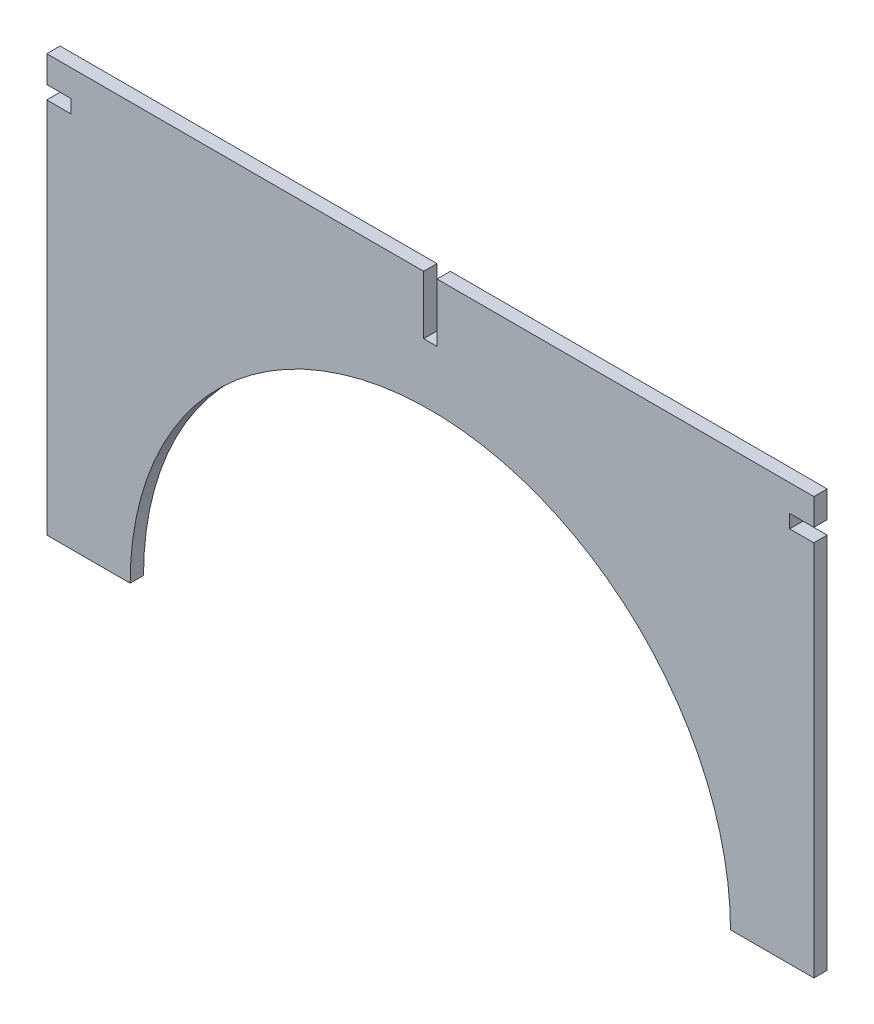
from build123d import *

# Parameters (mm, degrees)
BOSS_EXTRUDE1_DEPTH = 16
SKETCH3_W           = 29
SKETCH3_H           = 16
CUT_EXTRUDE9_DEPTH  = 16


with BuildPart() as part:
    # Sketch2 → Boss-Extrude1 (new body)
    with BuildSketch(Plane.XY):
        with BuildLine():
            Line((-429.073782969, -360), (-329.073782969, -360))
            ThreePointArc((-329.073782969, -360), (30.926217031, 0), (390.926217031, -360))
            Line((390.926217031, -360), (490.926217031, -360))
            Line((490.926217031, -360), (490.926217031, 140))
            Line((490.926217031, 140), (38.926217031, 140))
            Line((38.926217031, 140), (38.926217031, 70))
            Line((38.926217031, 70), (22.926217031, 70))
            Line((22.926217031, 70), (22.926217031, 140))
            Line((22.926217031, 140), (-429.073782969, 140))
            Line((-429.073782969, 140), (-429.073782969, -360))
        make_face()
    extrude(amount=BOSS_EXTRUDE1_DEPTH)

    # Sketch3 → Cut-Extrude9 (cut)
    with BuildSketch(Plane.XY):
        with Locations((-414.573782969, 100)):
            Rectangle(SKETCH3_W, SKETCH3_H)
        with Locations((476.426217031, 100)):
            Rectangle(SKETCH3_W, SKETCH3_H)
    extrude(amount=CUT_EXTRUDE9_DEPTH, mode=Mode.SUBTRACT)


solid = part.part
